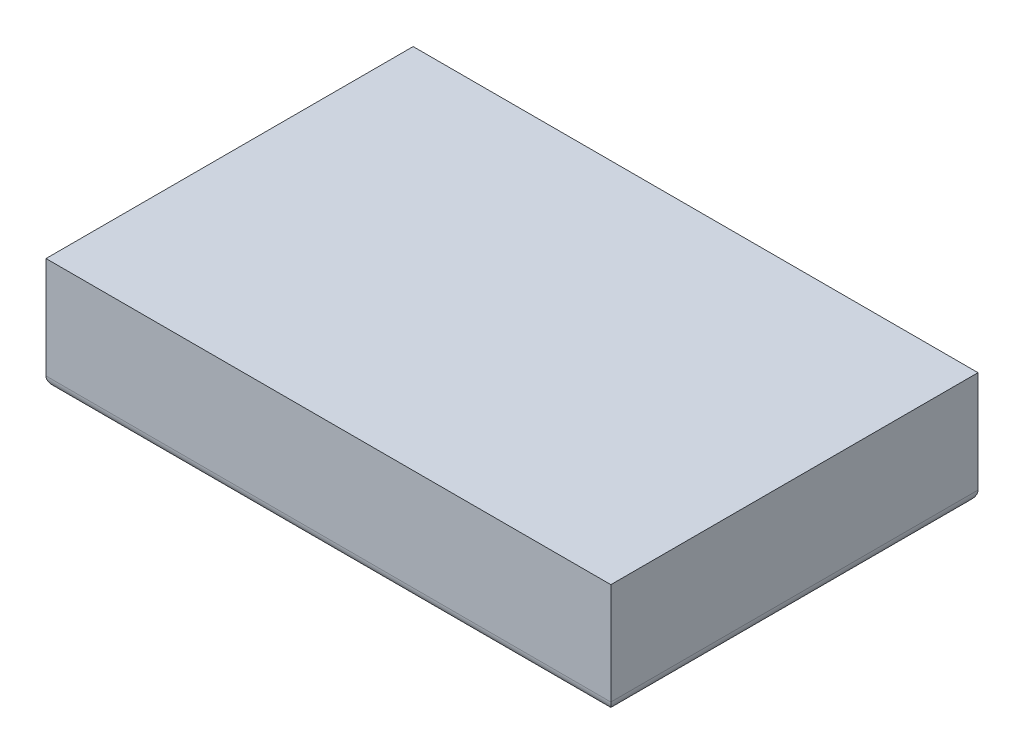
ISO-10303-21;
HEADER;
FILE_DESCRIPTION(('STEP AP214'),'2;1');
FILE_NAME('part.step','',(''),(''),'','','');
FILE_SCHEMA(('AUTOMOTIVE_DESIGN { 1 0 10303 214 1 1 1 1 }'));
ENDSEC;
DATA;
#1=APPLICATION_CONTEXT('core data for automotive mechanical design processes');
#2=APPLICATION_PROTOCOL_DEFINITION('international standard','automotive_design',2000,#1);
#3=PRODUCT_CONTEXT('',#1,'mechanical');
#4=PRODUCT('Part','Part','',(#3));
#5=PRODUCT_RELATED_PRODUCT_CATEGORY('part','',(#4));
#6=PRODUCT_DEFINITION_FORMATION('','',#4);
#7=PRODUCT_DEFINITION_CONTEXT('part definition',#1,'design');
#8=PRODUCT_DEFINITION('design','',#6,#7);
#9=PRODUCT_DEFINITION_SHAPE('','',#8);
#10=(LENGTH_UNIT() NAMED_UNIT(*) SI_UNIT(.MILLI.,.METRE.));
#11=(NAMED_UNIT(*) PLANE_ANGLE_UNIT() SI_UNIT($,.RADIAN.));
#12=(NAMED_UNIT(*) SI_UNIT($,.STERADIAN.) SOLID_ANGLE_UNIT());
#13=UNCERTAINTY_MEASURE_WITH_UNIT(LENGTH_MEASURE(1.E-05),#10,'distance_accuracy_value','');
#14=(GEOMETRIC_REPRESENTATION_CONTEXT(3) GLOBAL_UNCERTAINTY_ASSIGNED_CONTEXT((#13)) GLOBAL_UNIT_ASSIGNED_CONTEXT((#10,
#11,#12)) REPRESENTATION_CONTEXT('',''));
#15=CARTESIAN_POINT('',(0.,0.,0.));
#16=DIRECTION('',(0.,0.,1.));
#17=DIRECTION('',(1.,0.,0.));
#18=AXIS2_PLACEMENT_3D('',#15,#16,#17);
#19=CARTESIAN_POINT('',(5.,2.,-3.25));
#20=DIRECTION('',(-1.,0.,0.));
#21=DIRECTION('',(0.,0.,1.));
#22=AXIS2_PLACEMENT_3D('',#19,#20,#21);
#23=PLANE('',#22);
#24=DIRECTION('',(0.,-1.,0.));
#25=VECTOR('',#24,1.);
#26=CARTESIAN_POINT('',(5.,2.,3.25));
#27=LINE('',#26,#25);
#28=CARTESIAN_POINT('',(5.,2.,3.25));
#29=VERTEX_POINT('',#28);
#30=CARTESIAN_POINT('',(5.,0.2,3.25));
#31=VERTEX_POINT('',#30);
#32=EDGE_CURVE('E153',#29,#31,#27,.T.);
#33=ORIENTED_EDGE('',*,*,#32,.T.);
#34=DIRECTION('',(0.,0.,-1.));
#35=VECTOR('',#34,1.);
#36=CARTESIAN_POINT('',(5.,0.2,-3.25));
#37=LINE('',#36,#35);
#38=CARTESIAN_POINT('',(5.,0.2,-3.25));
#39=VERTEX_POINT('',#38);
#40=EDGE_CURVE('E11',#31,#39,#37,.T.);
#41=ORIENTED_EDGE('',*,*,#40,.T.);
#42=DIRECTION('',(0.,-1.,0.));
#43=VECTOR('',#42,1.);
#44=CARTESIAN_POINT('',(5.,2.,-3.25));
#45=LINE('',#44,#43);
#46=CARTESIAN_POINT('',(5.,2.,-3.25));
#47=VERTEX_POINT('',#46);
#48=EDGE_CURVE('E95',#47,#39,#45,.T.);
#49=ORIENTED_EDGE('',*,*,#48,.F.);
#50=DIRECTION('',(0.,0.,-1.));
#51=VECTOR('',#50,1.);
#52=CARTESIAN_POINT('',(5.,2.,-3.25));
#53=LINE('',#52,#51);
#54=EDGE_CURVE('E101',#29,#47,#53,.T.);
#55=ORIENTED_EDGE('',*,*,#54,.F.);
#56=EDGE_LOOP('',(#33,#41,#49,#55));
#57=FACE_BOUND('',#56,.T.);
#58=ADVANCED_FACE('F34',(#57),#23,.F.);
#59=CARTESIAN_POINT('',(-5.,2.,-3.25));
#60=DIRECTION('',(0.,0.,1.));
#61=DIRECTION('',(1.,0.,0.));
#62=AXIS2_PLACEMENT_3D('',#59,#60,#61);
#63=PLANE('',#62);
#64=ORIENTED_EDGE('',*,*,#48,.T.);
#65=DIRECTION('',(-1.,0.,0.));
#66=VECTOR('',#65,1.);
#67=CARTESIAN_POINT('',(-5.,0.2,-3.25));
#68=LINE('',#67,#66);
#69=CARTESIAN_POINT('',(-5.,0.2,-3.25));
#70=VERTEX_POINT('',#69);
#71=EDGE_CURVE('E110',#39,#70,#68,.T.);
#72=ORIENTED_EDGE('',*,*,#71,.T.);
#73=DIRECTION('',(0.,-1.,0.));
#74=VECTOR('',#73,1.);
#75=CARTESIAN_POINT('',(-5.,2.,-3.25));
#76=LINE('',#75,#74);
#77=CARTESIAN_POINT('',(-5.,2.,-3.25));
#78=VERTEX_POINT('',#77);
#79=EDGE_CURVE('E97',#78,#70,#76,.T.);
#80=ORIENTED_EDGE('',*,*,#79,.F.);
#81=DIRECTION('',(-1.,0.,0.));
#82=VECTOR('',#81,1.);
#83=CARTESIAN_POINT('',(-5.,2.,-3.25));
#84=LINE('',#83,#82);
#85=EDGE_CURVE('E90',#47,#78,#84,.T.);
#86=ORIENTED_EDGE('',*,*,#85,.F.);
#87=EDGE_LOOP('',(#64,#72,#80,#86));
#88=FACE_BOUND('',#87,.T.);
#89=ADVANCED_FACE('F92',(#88),#63,.F.);
#90=CARTESIAN_POINT('',(-5.,2.,-3.25));
#91=DIRECTION('',(1.,0.,0.));
#92=DIRECTION('',(0.,0.,-1.));
#93=AXIS2_PLACEMENT_3D('',#90,#91,#92);
#94=PLANE('',#93);
#95=ORIENTED_EDGE('',*,*,#79,.T.);
#96=DIRECTION('',(0.,0.,1.));
#97=VECTOR('',#96,1.);
#98=CARTESIAN_POINT('',(-5.,0.2,-3.25));
#99=LINE('',#98,#97);
#100=CARTESIAN_POINT('',(-5.,0.2,3.25));
#101=VERTEX_POINT('',#100);
#102=EDGE_CURVE('E58',#70,#101,#99,.T.);
#103=ORIENTED_EDGE('',*,*,#102,.T.);
#104=DIRECTION('',(0.,-1.,0.));
#105=VECTOR('',#104,1.);
#106=CARTESIAN_POINT('',(-5.,2.,3.25));
#107=LINE('',#106,#105);
#108=CARTESIAN_POINT('',(-5.,2.,3.25));
#109=VERTEX_POINT('',#108);
#110=EDGE_CURVE('E114',#109,#101,#107,.T.);
#111=ORIENTED_EDGE('',*,*,#110,.F.);
#112=DIRECTION('',(0.,0.,1.));
#113=VECTOR('',#112,1.);
#114=CARTESIAN_POINT('',(-5.,2.,-3.25));
#115=LINE('',#114,#113);
#116=EDGE_CURVE('E100',#78,#109,#115,.T.);
#117=ORIENTED_EDGE('',*,*,#116,.F.);
#118=EDGE_LOOP('',(#95,#103,#111,#117));
#119=FACE_BOUND('',#118,.T.);
#120=ADVANCED_FACE('F151',(#119),#94,.F.);
#121=CARTESIAN_POINT('',(-5.,2.,3.25));
#122=DIRECTION('',(0.,0.,-1.));
#123=DIRECTION('',(-1.,0.,0.));
#124=AXIS2_PLACEMENT_3D('',#121,#122,#123);
#125=PLANE('',#124);
#126=ORIENTED_EDGE('',*,*,#110,.T.);
#127=DIRECTION('',(1.,0.,0.));
#128=VECTOR('',#127,1.);
#129=CARTESIAN_POINT('',(-5.,0.2,3.25));
#130=LINE('',#129,#128);
#131=EDGE_CURVE('E43',#101,#31,#130,.T.);
#132=ORIENTED_EDGE('',*,*,#131,.T.);
#133=ORIENTED_EDGE('',*,*,#32,.F.);
#134=DIRECTION('',(1.,0.,0.));
#135=VECTOR('',#134,1.);
#136=CARTESIAN_POINT('',(-5.,2.,3.25));
#137=LINE('',#136,#135);
#138=EDGE_CURVE('E106',#109,#29,#137,.T.);
#139=ORIENTED_EDGE('',*,*,#138,.F.);
#140=EDGE_LOOP('',(#126,#132,#133,#139));
#141=FACE_BOUND('',#140,.T.);
#142=ADVANCED_FACE('F156',(#141),#125,.F.);
#143=CARTESIAN_POINT('',(0.,2.,0.));
#144=DIRECTION('',(0.,1.,0.));
#145=DIRECTION('',(0.,0.,1.));
#146=AXIS2_PLACEMENT_3D('',#143,#144,#145);
#147=PLANE('',#146);
#148=ORIENTED_EDGE('',*,*,#54,.T.);
#149=ORIENTED_EDGE('',*,*,#85,.T.);
#150=ORIENTED_EDGE('',*,*,#116,.T.);
#151=ORIENTED_EDGE('',*,*,#138,.T.);
#152=EDGE_LOOP('',(#148,#149,#150,#151));
#153=FACE_BOUND('',#152,.T.);
#154=ADVANCED_FACE('F104',(#153),#147,.T.);
#155=CARTESIAN_POINT('',(0.,0.,0.));
#156=DIRECTION('',(0.,1.,0.));
#157=DIRECTION('',(0.,0.,1.));
#158=AXIS2_PLACEMENT_3D('',#155,#156,#157);
#159=PLANE('',#158);
#160=DIRECTION('',(0.,0.,1.));
#161=VECTOR('',#160,1.);
#162=CARTESIAN_POINT('',(-4.8,0.,0.));
#163=LINE('',#162,#161);
#164=CARTESIAN_POINT('',(-4.8,0.,3.05));
#165=VERTEX_POINT('',#164);
#166=CARTESIAN_POINT('',(-4.8,0.,-3.05));
#167=VERTEX_POINT('',#166);
#168=EDGE_CURVE('E121',#165,#167,#163,.F.);
#169=ORIENTED_EDGE('',*,*,#168,.T.);
#170=DIRECTION('',(-1.,0.,0.));
#171=VECTOR('',#170,1.);
#172=CARTESIAN_POINT('',(0.,0.,-3.05));
#173=LINE('',#172,#171);
#174=CARTESIAN_POINT('',(4.8,0.,-3.05));
#175=VERTEX_POINT('',#174);
#176=EDGE_CURVE('E123',#167,#175,#173,.F.);
#177=ORIENTED_EDGE('',*,*,#176,.T.);
#178=DIRECTION('',(0.,0.,-1.));
#179=VECTOR('',#178,1.);
#180=CARTESIAN_POINT('',(4.8,0.,0.));
#181=LINE('',#180,#179);
#182=CARTESIAN_POINT('',(4.8,0.,3.05));
#183=VERTEX_POINT('',#182);
#184=EDGE_CURVE('E112',#175,#183,#181,.F.);
#185=ORIENTED_EDGE('',*,*,#184,.T.);
#186=DIRECTION('',(1.,0.,0.));
#187=VECTOR('',#186,1.);
#188=CARTESIAN_POINT('',(0.,0.,3.05));
#189=LINE('',#188,#187);
#190=EDGE_CURVE('E119',#183,#165,#189,.F.);
#191=ORIENTED_EDGE('',*,*,#190,.T.);
#192=EDGE_LOOP('',(#169,#177,#185,#191));
#193=FACE_BOUND('',#192,.T.);
#194=ADVANCED_FACE('F144',(#193),#159,.F.);
#195=CARTESIAN_POINT('',(-5.,0.2,3.05));
#196=DIRECTION('',(1.,0.,0.));
#197=DIRECTION('',(0.,0.,-1.));
#198=AXIS2_PLACEMENT_3D('',#195,#196,#197);
#199=CYLINDRICAL_SURFACE('',#198,0.2);
#200=CARTESIAN_POINT('',(-4.8,0.2,3.05));
#201=DIRECTION('',(0.707106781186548,0.,0.707106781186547));
#202=DIRECTION('',(0.707106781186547,0.,-0.707106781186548));
#203=AXIS2_PLACEMENT_3D('',#200,#201,#202);
#204=ELLIPSE('',#203,0.282842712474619,0.2);
#205=EDGE_CURVE('E131',#165,#101,#204,.F.);
#206=ORIENTED_EDGE('',*,*,#205,.F.);
#207=ORIENTED_EDGE('',*,*,#190,.F.);
#208=CARTESIAN_POINT('',(4.8,0.2,3.05));
#209=DIRECTION('',(0.707106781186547,0.,-0.707106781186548));
#210=DIRECTION('',(-0.707106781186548,0.,-0.707106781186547));
#211=AXIS2_PLACEMENT_3D('',#208,#209,#210);
#212=ELLIPSE('',#211,0.282842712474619,0.2);
#213=EDGE_CURVE('E38',#31,#183,#212,.T.);
#214=ORIENTED_EDGE('',*,*,#213,.F.);
#215=ORIENTED_EDGE('',*,*,#131,.F.);
#216=EDGE_LOOP('',(#206,#207,#214,#215));
#217=FACE_BOUND('',#216,.T.);
#218=ADVANCED_FACE('F36',(#217),#199,.T.);
#219=CARTESIAN_POINT('',(4.8,0.2,-3.25));
#220=DIRECTION('',(0.,0.,-1.));
#221=DIRECTION('',(-1.,0.,0.));
#222=AXIS2_PLACEMENT_3D('',#219,#220,#221);
#223=CYLINDRICAL_SURFACE('',#222,0.2);
#224=ORIENTED_EDGE('',*,*,#213,.T.);
#225=ORIENTED_EDGE('',*,*,#184,.F.);
#226=CARTESIAN_POINT('',(4.8,0.2,-3.05));
#227=DIRECTION('',(-0.707106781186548,0.,-0.707106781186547));
#228=DIRECTION('',(0.707106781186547,0.,-0.707106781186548));
#229=AXIS2_PLACEMENT_3D('',#226,#227,#228);
#230=ELLIPSE('',#229,0.282842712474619,0.2);
#231=EDGE_CURVE('E130',#39,#175,#230,.T.);
#232=ORIENTED_EDGE('',*,*,#231,.F.);
#233=ORIENTED_EDGE('',*,*,#40,.F.);
#234=EDGE_LOOP('',(#224,#225,#232,#233));
#235=FACE_BOUND('',#234,.T.);
#236=ADVANCED_FACE('F140',(#235),#223,.T.);
#237=CARTESIAN_POINT('',(-4.8,0.2,-3.25));
#238=DIRECTION('',(0.,0.,1.));
#239=DIRECTION('',(1.,0.,0.));
#240=AXIS2_PLACEMENT_3D('',#237,#238,#239);
#241=CYLINDRICAL_SURFACE('',#240,0.2);
#242=ORIENTED_EDGE('',*,*,#205,.T.);
#243=ORIENTED_EDGE('',*,*,#102,.F.);
#244=CARTESIAN_POINT('',(-4.8,0.2,-3.05));
#245=DIRECTION('',(-0.707106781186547,0.,0.707106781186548));
#246=DIRECTION('',(0.707106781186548,0.,0.707106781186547));
#247=AXIS2_PLACEMENT_3D('',#244,#245,#246);
#248=ELLIPSE('',#247,0.282842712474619,0.2);
#249=EDGE_CURVE('E128',#167,#70,#248,.F.);
#250=ORIENTED_EDGE('',*,*,#249,.F.);
#251=ORIENTED_EDGE('',*,*,#168,.F.);
#252=EDGE_LOOP('',(#242,#243,#250,#251));
#253=FACE_BOUND('',#252,.T.);
#254=ADVANCED_FACE('F150',(#253),#241,.T.);
#255=CARTESIAN_POINT('',(-5.,0.2,-3.05));
#256=DIRECTION('',(-1.,0.,0.));
#257=DIRECTION('',(0.,0.,1.));
#258=AXIS2_PLACEMENT_3D('',#255,#256,#257);
#259=CYLINDRICAL_SURFACE('',#258,0.2);
#260=ORIENTED_EDGE('',*,*,#231,.T.);
#261=ORIENTED_EDGE('',*,*,#176,.F.);
#262=ORIENTED_EDGE('',*,*,#249,.T.);
#263=ORIENTED_EDGE('',*,*,#71,.F.);
#264=EDGE_LOOP('',(#260,#261,#262,#263));
#265=FACE_BOUND('',#264,.T.);
#266=ADVANCED_FACE('F148',(#265),#259,.T.);
#267=CLOSED_SHELL('',(#58,#89,#120,#142,#154,#194,#218,#236,#254,#266));
#268=MANIFOLD_SOLID_BREP('B2',#267);
#269=ADVANCED_BREP_SHAPE_REPRESENTATION('',(#18,#268),#14);
#270=SHAPE_DEFINITION_REPRESENTATION(#9,#269);
ENDSEC;
END-ISO-10303-21;
